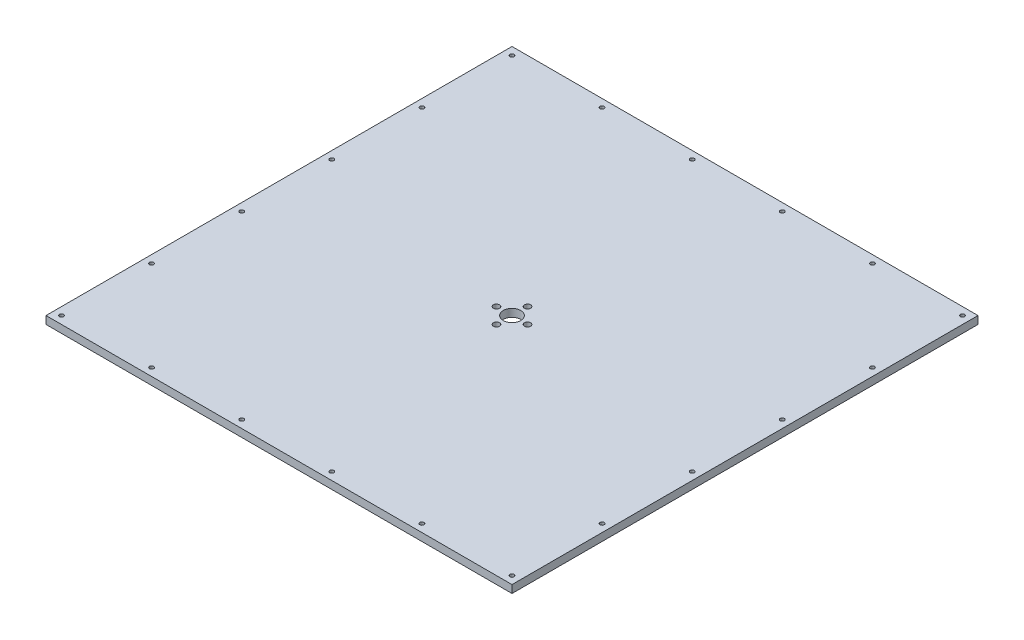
ISO-10303-21;
HEADER;
FILE_DESCRIPTION(('STEP AP214'),'2;1');
FILE_NAME('part.step','',(''),(''),'','','');
FILE_SCHEMA(('AUTOMOTIVE_DESIGN { 1 0 10303 214 1 1 1 1 }'));
ENDSEC;
DATA;
#1=APPLICATION_CONTEXT('core data for automotive mechanical design processes');
#2=APPLICATION_PROTOCOL_DEFINITION('international standard','automotive_design',2000,#1);
#3=PRODUCT_CONTEXT('',#1,'mechanical');
#4=PRODUCT('Part','Part','',(#3));
#5=PRODUCT_RELATED_PRODUCT_CATEGORY('part','',(#4));
#6=PRODUCT_DEFINITION_FORMATION('','',#4);
#7=PRODUCT_DEFINITION_CONTEXT('part definition',#1,'design');
#8=PRODUCT_DEFINITION('design','',#6,#7);
#9=PRODUCT_DEFINITION_SHAPE('','',#8);
#10=(LENGTH_UNIT() NAMED_UNIT(*) SI_UNIT(.MILLI.,.METRE.));
#11=(NAMED_UNIT(*) PLANE_ANGLE_UNIT() SI_UNIT($,.RADIAN.));
#12=(NAMED_UNIT(*) SI_UNIT($,.STERADIAN.) SOLID_ANGLE_UNIT());
#13=UNCERTAINTY_MEASURE_WITH_UNIT(LENGTH_MEASURE(1.E-05),#10,'distance_accuracy_value','');
#14=(GEOMETRIC_REPRESENTATION_CONTEXT(3) GLOBAL_UNCERTAINTY_ASSIGNED_CONTEXT((#13)) GLOBAL_UNIT_ASSIGNED_CONTEXT((#10,
#11,#12)) REPRESENTATION_CONTEXT('',''));
#15=CARTESIAN_POINT('',(0.,0.,0.));
#16=DIRECTION('',(0.,0.,1.));
#17=DIRECTION('',(1.,0.,0.));
#18=AXIS2_PLACEMENT_3D('',#15,#16,#17);
#19=CARTESIAN_POINT('',(381.,12.7,-381.));
#20=DIRECTION('',(-1.,0.,0.));
#21=DIRECTION('',(0.,0.,1.));
#22=AXIS2_PLACEMENT_3D('',#19,#20,#21);
#23=PLANE('',#22);
#24=DIRECTION('',(0.,0.,-1.));
#25=VECTOR('',#24,1.);
#26=CARTESIAN_POINT('',(381.,0.,-381.));
#27=LINE('',#26,#25);
#28=CARTESIAN_POINT('',(381.,0.,381.));
#29=VERTEX_POINT('',#28);
#30=CARTESIAN_POINT('',(381.,0.,-381.));
#31=VERTEX_POINT('',#30);
#32=EDGE_CURVE('E104',#29,#31,#27,.T.);
#33=ORIENTED_EDGE('',*,*,#32,.T.);
#34=DIRECTION('',(0.,-1.,0.));
#35=VECTOR('',#34,1.);
#36=CARTESIAN_POINT('',(381.,12.7,-381.));
#37=LINE('',#36,#35);
#38=CARTESIAN_POINT('',(381.,12.7,-381.));
#39=VERTEX_POINT('',#38);
#40=EDGE_CURVE('E95',#39,#31,#37,.T.);
#41=ORIENTED_EDGE('',*,*,#40,.F.);
#42=DIRECTION('',(0.,0.,-1.));
#43=VECTOR('',#42,1.);
#44=CARTESIAN_POINT('',(381.,12.7,-381.));
#45=LINE('',#44,#43);
#46=CARTESIAN_POINT('',(381.,12.7,381.));
#47=VERTEX_POINT('',#46);
#48=EDGE_CURVE('E89',#47,#39,#45,.T.);
#49=ORIENTED_EDGE('',*,*,#48,.F.);
#50=DIRECTION('',(0.,-1.,0.));
#51=VECTOR('',#50,1.);
#52=CARTESIAN_POINT('',(381.,12.7,381.));
#53=LINE('',#52,#51);
#54=EDGE_CURVE('E100',#47,#29,#53,.T.);
#55=ORIENTED_EDGE('',*,*,#54,.T.);
#56=EDGE_LOOP('',(#33,#41,#49,#55));
#57=FACE_BOUND('',#56,.T.);
#58=ADVANCED_FACE('F35',(#57),#23,.F.);
#59=CARTESIAN_POINT('',(-381.,12.7,-381.));
#60=DIRECTION('',(0.,0.,1.));
#61=DIRECTION('',(1.,0.,0.));
#62=AXIS2_PLACEMENT_3D('',#59,#60,#61);
#63=PLANE('',#62);
#64=DIRECTION('',(-1.,0.,0.));
#65=VECTOR('',#64,1.);
#66=CARTESIAN_POINT('',(-381.,0.,-381.));
#67=LINE('',#66,#65);
#68=CARTESIAN_POINT('',(-381.,0.,-381.));
#69=VERTEX_POINT('',#68);
#70=EDGE_CURVE('E94',#31,#69,#67,.T.);
#71=ORIENTED_EDGE('',*,*,#70,.T.);
#72=DIRECTION('',(0.,-1.,0.));
#73=VECTOR('',#72,1.);
#74=CARTESIAN_POINT('',(-381.,12.7,-381.));
#75=LINE('',#74,#73);
#76=CARTESIAN_POINT('',(-381.,12.7,-381.));
#77=VERTEX_POINT('',#76);
#78=EDGE_CURVE('E92',#77,#69,#75,.T.);
#79=ORIENTED_EDGE('',*,*,#78,.F.);
#80=DIRECTION('',(-1.,0.,0.));
#81=VECTOR('',#80,1.);
#82=CARTESIAN_POINT('',(-381.,12.7,-381.));
#83=LINE('',#82,#81);
#84=EDGE_CURVE('E83',#39,#77,#83,.T.);
#85=ORIENTED_EDGE('',*,*,#84,.F.);
#86=ORIENTED_EDGE('',*,*,#40,.T.);
#87=EDGE_LOOP('',(#71,#79,#85,#86));
#88=FACE_BOUND('',#87,.T.);
#89=ADVANCED_FACE('F93',(#88),#63,.F.);
#90=CARTESIAN_POINT('',(-381.,12.7,-381.));
#91=DIRECTION('',(1.,0.,0.));
#92=DIRECTION('',(0.,0.,-1.));
#93=AXIS2_PLACEMENT_3D('',#90,#91,#92);
#94=PLANE('',#93);
#95=DIRECTION('',(0.,0.,1.));
#96=VECTOR('',#95,1.);
#97=CARTESIAN_POINT('',(-381.,0.,-381.));
#98=LINE('',#97,#96);
#99=CARTESIAN_POINT('',(-381.,0.,381.));
#100=VERTEX_POINT('',#99);
#101=EDGE_CURVE('E69',#69,#100,#98,.T.);
#102=ORIENTED_EDGE('',*,*,#101,.T.);
#103=DIRECTION('',(0.,-1.,0.));
#104=VECTOR('',#103,1.);
#105=CARTESIAN_POINT('',(-381.,12.7,381.));
#106=LINE('',#105,#104);
#107=CARTESIAN_POINT('',(-381.,12.7,381.));
#108=VERTEX_POINT('',#107);
#109=EDGE_CURVE('E96',#108,#100,#106,.T.);
#110=ORIENTED_EDGE('',*,*,#109,.F.);
#111=DIRECTION('',(0.,0.,1.));
#112=VECTOR('',#111,1.);
#113=CARTESIAN_POINT('',(-381.,12.7,-381.));
#114=LINE('',#113,#112);
#115=EDGE_CURVE('E87',#77,#108,#114,.T.);
#116=ORIENTED_EDGE('',*,*,#115,.F.);
#117=ORIENTED_EDGE('',*,*,#78,.T.);
#118=EDGE_LOOP('',(#102,#110,#116,#117));
#119=FACE_BOUND('',#118,.T.);
#120=ADVANCED_FACE('F98',(#119),#94,.F.);
#121=CARTESIAN_POINT('',(-381.,12.7,381.));
#122=DIRECTION('',(0.,0.,-1.));
#123=DIRECTION('',(-1.,0.,0.));
#124=AXIS2_PLACEMENT_3D('',#121,#122,#123);
#125=PLANE('',#124);
#126=DIRECTION('',(1.,0.,0.));
#127=VECTOR('',#126,1.);
#128=CARTESIAN_POINT('',(-381.,0.,381.));
#129=LINE('',#128,#127);
#130=EDGE_CURVE('E75',#100,#29,#129,.T.);
#131=ORIENTED_EDGE('',*,*,#130,.T.);
#132=ORIENTED_EDGE('',*,*,#54,.F.);
#133=DIRECTION('',(1.,0.,0.));
#134=VECTOR('',#133,1.);
#135=CARTESIAN_POINT('',(-381.,12.7,381.));
#136=LINE('',#135,#134);
#137=EDGE_CURVE('E52',#108,#47,#136,.T.);
#138=ORIENTED_EDGE('',*,*,#137,.F.);
#139=ORIENTED_EDGE('',*,*,#109,.T.);
#140=EDGE_LOOP('',(#131,#132,#138,#139));
#141=FACE_BOUND('',#140,.T.);
#142=ADVANCED_FACE('F227',(#141),#125,.F.);
#143=CARTESIAN_POINT('',(0.,12.7,0.));
#144=DIRECTION('',(0.,1.,0.));
#145=DIRECTION('',(0.,0.,1.));
#146=AXIS2_PLACEMENT_3D('',#143,#144,#145);
#147=PLANE('',#146);
#148=CARTESIAN_POINT('',(0.,12.7,-25.4));
#149=DIRECTION('',(0.,1.,0.));
#150=DIRECTION('',(0.,0.,1.));
#151=AXIS2_PLACEMENT_3D('',#148,#149,#150);
#152=CIRCLE('',#151,5.04189999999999);
#153=CARTESIAN_POINT('',(0.,12.7,-20.3581));
#154=VERTEX_POINT('',#153);
#155=EDGE_CURVE('E571',#154,#154,#152,.T.);
#156=ORIENTED_EDGE('',*,*,#155,.F.);
#157=EDGE_LOOP('',(#156));
#158=FACE_BOUND('',#157,.T.);
#159=CARTESIAN_POINT('',(25.4,12.7,0.));
#160=DIRECTION('',(0.,1.,0.));
#161=DIRECTION('',(0.,0.,1.));
#162=AXIS2_PLACEMENT_3D('',#159,#160,#161);
#163=CIRCLE('',#162,5.04189999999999);
#164=CARTESIAN_POINT('',(25.4,12.7,5.04189999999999));
#165=VERTEX_POINT('',#164);
#166=EDGE_CURVE('E565',#165,#165,#163,.T.);
#167=ORIENTED_EDGE('',*,*,#166,.F.);
#168=EDGE_LOOP('',(#167));
#169=FACE_BOUND('',#168,.T.);
#170=CARTESIAN_POINT('',(0.,12.7,25.4));
#171=DIRECTION('',(0.,1.,0.));
#172=DIRECTION('',(0.,0.,1.));
#173=AXIS2_PLACEMENT_3D('',#170,#171,#172);
#174=CIRCLE('',#173,5.04189999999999);
#175=CARTESIAN_POINT('',(0.,12.7,30.4419));
#176=VERTEX_POINT('',#175);
#177=EDGE_CURVE('E559',#176,#176,#174,.T.);
#178=ORIENTED_EDGE('',*,*,#177,.F.);
#179=EDGE_LOOP('',(#178));
#180=FACE_BOUND('',#179,.T.);
#181=CARTESIAN_POINT('',(-25.4,12.7,0.));
#182=DIRECTION('',(0.,1.,0.));
#183=DIRECTION('',(0.,0.,1.));
#184=AXIS2_PLACEMENT_3D('',#181,#182,#183);
#185=CIRCLE('',#184,5.04189999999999);
#186=CARTESIAN_POINT('',(-25.4,12.7,5.04189999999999));
#187=VERTEX_POINT('',#186);
#188=EDGE_CURVE('E553',#187,#187,#185,.T.);
#189=ORIENTED_EDGE('',*,*,#188,.F.);
#190=EDGE_LOOP('',(#189));
#191=FACE_BOUND('',#190,.T.);
#192=CARTESIAN_POINT('',(0.,12.7,0.));
#193=DIRECTION('',(0.,1.,0.));
#194=DIRECTION('',(0.,0.,1.));
#195=AXIS2_PLACEMENT_3D('',#192,#193,#194);
#196=CIRCLE('',#195,14.2875);
#197=CARTESIAN_POINT('',(0.,12.7,14.2875));
#198=VERTEX_POINT('',#197);
#199=EDGE_CURVE('E545',#198,#198,#196,.T.);
#200=ORIENTED_EDGE('',*,*,#199,.F.);
#201=EDGE_LOOP('',(#200));
#202=FACE_BOUND('',#201,.T.);
#203=CARTESIAN_POINT('',(-220.98,12.7,-368.3));
#204=DIRECTION('',(0.,1.,0.));
#205=DIRECTION('',(0.,0.,1.));
#206=AXIS2_PLACEMENT_3D('',#203,#204,#205);
#207=CIRCLE('',#206,3.3782);
#208=CARTESIAN_POINT('',(-220.98,12.7,-364.9218));
#209=VERTEX_POINT('',#208);
#210=EDGE_CURVE('E535',#209,#209,#207,.T.);
#211=ORIENTED_EDGE('',*,*,#210,.F.);
#212=EDGE_LOOP('',(#211));
#213=FACE_BOUND('',#212,.T.);
#214=CARTESIAN_POINT('',(-368.3,12.7,-368.3));
#215=DIRECTION('',(0.,1.,0.));
#216=DIRECTION('',(0.,0.,1.));
#217=AXIS2_PLACEMENT_3D('',#214,#215,#216);
#218=CIRCLE('',#217,3.3782);
#219=CARTESIAN_POINT('',(-368.3,12.7,-364.9218));
#220=VERTEX_POINT('',#219);
#221=EDGE_CURVE('E533',#220,#220,#218,.T.);
#222=ORIENTED_EDGE('',*,*,#221,.F.);
#223=EDGE_LOOP('',(#222));
#224=FACE_BOUND('',#223,.T.);
#225=ORIENTED_EDGE('',*,*,#48,.T.);
#226=ORIENTED_EDGE('',*,*,#84,.T.);
#227=ORIENTED_EDGE('',*,*,#115,.T.);
#228=ORIENTED_EDGE('',*,*,#137,.T.);
#229=EDGE_LOOP('',(#225,#226,#227,#228));
#230=FACE_BOUND('',#229,.T.);
#231=CARTESIAN_POINT('',(-73.6600000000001,12.7,-368.3));
#232=DIRECTION('',(0.,1.,0.));
#233=DIRECTION('',(0.,0.,1.));
#234=AXIS2_PLACEMENT_3D('',#231,#232,#233);
#235=CIRCLE('',#234,3.3782);
#236=CARTESIAN_POINT('',(-73.6600000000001,12.7,-364.9218));
#237=VERTEX_POINT('',#236);
#238=EDGE_CURVE('E117',#237,#237,#235,.T.);
#239=ORIENTED_EDGE('',*,*,#238,.F.);
#240=EDGE_LOOP('',(#239));
#241=FACE_BOUND('',#240,.T.);
#242=CARTESIAN_POINT('',(73.6599999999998,12.7,-368.3));
#243=DIRECTION('',(0.,1.,0.));
#244=DIRECTION('',(0.,0.,1.));
#245=AXIS2_PLACEMENT_3D('',#242,#243,#244);
#246=CIRCLE('',#245,3.3782);
#247=CARTESIAN_POINT('',(73.6599999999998,12.7,-364.9218));
#248=VERTEX_POINT('',#247);
#249=EDGE_CURVE('E123',#248,#248,#246,.T.);
#250=ORIENTED_EDGE('',*,*,#249,.F.);
#251=EDGE_LOOP('',(#250));
#252=FACE_BOUND('',#251,.T.);
#253=CARTESIAN_POINT('',(220.98,12.7,-368.3));
#254=DIRECTION('',(0.,1.,0.));
#255=DIRECTION('',(0.,0.,1.));
#256=AXIS2_PLACEMENT_3D('',#253,#254,#255);
#257=CIRCLE('',#256,3.3782);
#258=CARTESIAN_POINT('',(220.98,12.7,-364.9218));
#259=VERTEX_POINT('',#258);
#260=EDGE_CURVE('E129',#259,#259,#257,.T.);
#261=ORIENTED_EDGE('',*,*,#260,.F.);
#262=EDGE_LOOP('',(#261));
#263=FACE_BOUND('',#262,.T.);
#264=CARTESIAN_POINT('',(368.3,12.7,-368.3));
#265=DIRECTION('',(0.,1.,0.));
#266=DIRECTION('',(0.,0.,1.));
#267=AXIS2_PLACEMENT_3D('',#264,#265,#266);
#268=CIRCLE('',#267,3.3782);
#269=CARTESIAN_POINT('',(368.3,12.7,-364.9218));
#270=VERTEX_POINT('',#269);
#271=EDGE_CURVE('E135',#270,#270,#268,.T.);
#272=ORIENTED_EDGE('',*,*,#271,.F.);
#273=EDGE_LOOP('',(#272));
#274=FACE_BOUND('',#273,.T.);
#275=CARTESIAN_POINT('',(-368.3,12.7,-220.98));
#276=DIRECTION('',(0.,1.,0.));
#277=DIRECTION('',(0.,0.,1.));
#278=AXIS2_PLACEMENT_3D('',#275,#276,#277);
#279=CIRCLE('',#278,3.3782);
#280=CARTESIAN_POINT('',(-368.3,12.7,-217.6018));
#281=VERTEX_POINT('',#280);
#282=EDGE_CURVE('E141',#281,#281,#279,.T.);
#283=ORIENTED_EDGE('',*,*,#282,.F.);
#284=EDGE_LOOP('',(#283));
#285=FACE_BOUND('',#284,.T.);
#286=CARTESIAN_POINT('',(368.3,12.7,-220.98));
#287=DIRECTION('',(0.,1.,0.));
#288=DIRECTION('',(0.,0.,1.));
#289=AXIS2_PLACEMENT_3D('',#286,#287,#288);
#290=CIRCLE('',#289,3.3782);
#291=CARTESIAN_POINT('',(368.3,12.7,-217.6018));
#292=VERTEX_POINT('',#291);
#293=EDGE_CURVE('E147',#292,#292,#290,.T.);
#294=ORIENTED_EDGE('',*,*,#293,.F.);
#295=EDGE_LOOP('',(#294));
#296=FACE_BOUND('',#295,.T.);
#297=CARTESIAN_POINT('',(-368.3,12.7,-73.6600000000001));
#298=DIRECTION('',(0.,1.,0.));
#299=DIRECTION('',(0.,0.,1.));
#300=AXIS2_PLACEMENT_3D('',#297,#298,#299);
#301=CIRCLE('',#300,3.3782);
#302=CARTESIAN_POINT('',(-368.3,12.7,-70.2818000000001));
#303=VERTEX_POINT('',#302);
#304=EDGE_CURVE('E153',#303,#303,#301,.T.);
#305=ORIENTED_EDGE('',*,*,#304,.F.);
#306=EDGE_LOOP('',(#305));
#307=FACE_BOUND('',#306,.T.);
#308=CARTESIAN_POINT('',(368.3,12.7,-73.6600000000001));
#309=DIRECTION('',(0.,1.,0.));
#310=DIRECTION('',(0.,0.,1.));
#311=AXIS2_PLACEMENT_3D('',#308,#309,#310);
#312=CIRCLE('',#311,3.3782);
#313=CARTESIAN_POINT('',(368.3,12.7,-70.2818000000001));
#314=VERTEX_POINT('',#313);
#315=EDGE_CURVE('E159',#314,#314,#312,.T.);
#316=ORIENTED_EDGE('',*,*,#315,.F.);
#317=EDGE_LOOP('',(#316));
#318=FACE_BOUND('',#317,.T.);
#319=CARTESIAN_POINT('',(-368.3,12.7,73.6599999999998));
#320=DIRECTION('',(0.,1.,0.));
#321=DIRECTION('',(0.,0.,1.));
#322=AXIS2_PLACEMENT_3D('',#319,#320,#321);
#323=CIRCLE('',#322,3.3782);
#324=CARTESIAN_POINT('',(-368.3,12.7,77.0381999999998));
#325=VERTEX_POINT('',#324);
#326=EDGE_CURVE('E165',#325,#325,#323,.T.);
#327=ORIENTED_EDGE('',*,*,#326,.F.);
#328=EDGE_LOOP('',(#327));
#329=FACE_BOUND('',#328,.T.);
#330=CARTESIAN_POINT('',(368.3,12.7,73.6599999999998));
#331=DIRECTION('',(0.,1.,0.));
#332=DIRECTION('',(0.,0.,1.));
#333=AXIS2_PLACEMENT_3D('',#330,#331,#332);
#334=CIRCLE('',#333,3.3782);
#335=CARTESIAN_POINT('',(368.3,12.7,77.0381999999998));
#336=VERTEX_POINT('',#335);
#337=EDGE_CURVE('E171',#336,#336,#334,.T.);
#338=ORIENTED_EDGE('',*,*,#337,.F.);
#339=EDGE_LOOP('',(#338));
#340=FACE_BOUND('',#339,.T.);
#341=CARTESIAN_POINT('',(-368.3,12.7,220.98));
#342=DIRECTION('',(0.,1.,0.));
#343=DIRECTION('',(0.,0.,1.));
#344=AXIS2_PLACEMENT_3D('',#341,#342,#343);
#345=CIRCLE('',#344,3.3782);
#346=CARTESIAN_POINT('',(-368.3,12.7,224.3582));
#347=VERTEX_POINT('',#346);
#348=EDGE_CURVE('E177',#347,#347,#345,.T.);
#349=ORIENTED_EDGE('',*,*,#348,.F.);
#350=EDGE_LOOP('',(#349));
#351=FACE_BOUND('',#350,.T.);
#352=CARTESIAN_POINT('',(368.3,12.7,220.98));
#353=DIRECTION('',(0.,1.,0.));
#354=DIRECTION('',(0.,0.,1.));
#355=AXIS2_PLACEMENT_3D('',#352,#353,#354);
#356=CIRCLE('',#355,3.3782);
#357=CARTESIAN_POINT('',(368.3,12.7,224.3582));
#358=VERTEX_POINT('',#357);
#359=EDGE_CURVE('E183',#358,#358,#356,.T.);
#360=ORIENTED_EDGE('',*,*,#359,.F.);
#361=EDGE_LOOP('',(#360));
#362=FACE_BOUND('',#361,.T.);
#363=CARTESIAN_POINT('',(-368.3,12.7,368.3));
#364=DIRECTION('',(0.,1.,0.));
#365=DIRECTION('',(0.,0.,1.));
#366=AXIS2_PLACEMENT_3D('',#363,#364,#365);
#367=CIRCLE('',#366,3.3782);
#368=CARTESIAN_POINT('',(-368.3,12.7,371.6782));
#369=VERTEX_POINT('',#368);
#370=EDGE_CURVE('E189',#369,#369,#367,.T.);
#371=ORIENTED_EDGE('',*,*,#370,.F.);
#372=EDGE_LOOP('',(#371));
#373=FACE_BOUND('',#372,.T.);
#374=CARTESIAN_POINT('',(-220.98,12.7,368.3));
#375=DIRECTION('',(0.,1.,0.));
#376=DIRECTION('',(0.,0.,1.));
#377=AXIS2_PLACEMENT_3D('',#374,#375,#376);
#378=CIRCLE('',#377,3.3782);
#379=CARTESIAN_POINT('',(-220.98,12.7,371.6782));
#380=VERTEX_POINT('',#379);
#381=EDGE_CURVE('E195',#380,#380,#378,.T.);
#382=ORIENTED_EDGE('',*,*,#381,.F.);
#383=EDGE_LOOP('',(#382));
#384=FACE_BOUND('',#383,.T.);
#385=CARTESIAN_POINT('',(-73.6600000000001,12.7,368.3));
#386=DIRECTION('',(0.,1.,0.));
#387=DIRECTION('',(0.,0.,1.));
#388=AXIS2_PLACEMENT_3D('',#385,#386,#387);
#389=CIRCLE('',#388,3.3782);
#390=CARTESIAN_POINT('',(-73.6600000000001,12.7,371.6782));
#391=VERTEX_POINT('',#390);
#392=EDGE_CURVE('E201',#391,#391,#389,.T.);
#393=ORIENTED_EDGE('',*,*,#392,.F.);
#394=EDGE_LOOP('',(#393));
#395=FACE_BOUND('',#394,.T.);
#396=CARTESIAN_POINT('',(73.6599999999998,12.7,368.3));
#397=DIRECTION('',(0.,1.,0.));
#398=DIRECTION('',(0.,0.,1.));
#399=AXIS2_PLACEMENT_3D('',#396,#397,#398);
#400=CIRCLE('',#399,3.3782);
#401=CARTESIAN_POINT('',(73.6599999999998,12.7,371.6782));
#402=VERTEX_POINT('',#401);
#403=EDGE_CURVE('E207',#402,#402,#400,.T.);
#404=ORIENTED_EDGE('',*,*,#403,.F.);
#405=EDGE_LOOP('',(#404));
#406=FACE_BOUND('',#405,.T.);
#407=CARTESIAN_POINT('',(220.98,12.7,368.3));
#408=DIRECTION('',(0.,1.,0.));
#409=DIRECTION('',(0.,0.,1.));
#410=AXIS2_PLACEMENT_3D('',#407,#408,#409);
#411=CIRCLE('',#410,3.3782);
#412=CARTESIAN_POINT('',(220.98,12.7,371.6782));
#413=VERTEX_POINT('',#412);
#414=EDGE_CURVE('E213',#413,#413,#411,.T.);
#415=ORIENTED_EDGE('',*,*,#414,.F.);
#416=EDGE_LOOP('',(#415));
#417=FACE_BOUND('',#416,.T.);
#418=CARTESIAN_POINT('',(368.3,12.7,368.3));
#419=DIRECTION('',(0.,1.,0.));
#420=DIRECTION('',(0.,0.,1.));
#421=AXIS2_PLACEMENT_3D('',#418,#419,#420);
#422=CIRCLE('',#421,3.3782);
#423=CARTESIAN_POINT('',(368.3,12.7,371.6782));
#424=VERTEX_POINT('',#423);
#425=EDGE_CURVE('E11',#424,#424,#422,.T.);
#426=ORIENTED_EDGE('',*,*,#425,.F.);
#427=EDGE_LOOP('',(#426));
#428=FACE_BOUND('',#427,.T.);
#429=ADVANCED_FACE('F84',(#158,#169,#180,#191,#202,#213,#224,#230,#241,#252,#263,#274,#285,#296,
#307,#318,#329,#340,#351,#362,#373,#384,#395,#406,#417,#428),#147,.T.);
#430=CARTESIAN_POINT('',(0.,0.,0.));
#431=DIRECTION('',(0.,1.,0.));
#432=DIRECTION('',(0.,0.,1.));
#433=AXIS2_PLACEMENT_3D('',#430,#431,#432);
#434=PLANE('',#433);
#435=CARTESIAN_POINT('',(0.,0.,-25.4));
#436=DIRECTION('',(0.,1.,0.));
#437=DIRECTION('',(0.,0.,1.));
#438=AXIS2_PLACEMENT_3D('',#435,#436,#437);
#439=CIRCLE('',#438,5.0419);
#440=CARTESIAN_POINT('',(0.,0.,-20.3581));
#441=VERTEX_POINT('',#440);
#442=EDGE_CURVE('E568',#441,#441,#439,.T.);
#443=ORIENTED_EDGE('',*,*,#442,.T.);
#444=EDGE_LOOP('',(#443));
#445=FACE_BOUND('',#444,.T.);
#446=CARTESIAN_POINT('',(25.4,0.,0.));
#447=DIRECTION('',(0.,1.,0.));
#448=DIRECTION('',(0.,0.,1.));
#449=AXIS2_PLACEMENT_3D('',#446,#447,#448);
#450=CIRCLE('',#449,5.0419);
#451=CARTESIAN_POINT('',(25.4,0.,5.0419));
#452=VERTEX_POINT('',#451);
#453=EDGE_CURVE('E562',#452,#452,#450,.T.);
#454=ORIENTED_EDGE('',*,*,#453,.T.);
#455=EDGE_LOOP('',(#454));
#456=FACE_BOUND('',#455,.T.);
#457=CARTESIAN_POINT('',(0.,0.,25.4));
#458=DIRECTION('',(0.,1.,0.));
#459=DIRECTION('',(0.,0.,1.));
#460=AXIS2_PLACEMENT_3D('',#457,#458,#459);
#461=CIRCLE('',#460,5.0419);
#462=CARTESIAN_POINT('',(0.,0.,30.4419));
#463=VERTEX_POINT('',#462);
#464=EDGE_CURVE('E556',#463,#463,#461,.T.);
#465=ORIENTED_EDGE('',*,*,#464,.T.);
#466=EDGE_LOOP('',(#465));
#467=FACE_BOUND('',#466,.T.);
#468=CARTESIAN_POINT('',(-25.4,0.,0.));
#469=DIRECTION('',(0.,1.,0.));
#470=DIRECTION('',(0.,0.,1.));
#471=AXIS2_PLACEMENT_3D('',#468,#469,#470);
#472=CIRCLE('',#471,5.0419);
#473=CARTESIAN_POINT('',(-25.4,0.,5.0419));
#474=VERTEX_POINT('',#473);
#475=EDGE_CURVE('E548',#474,#474,#472,.T.);
#476=ORIENTED_EDGE('',*,*,#475,.T.);
#477=EDGE_LOOP('',(#476));
#478=FACE_BOUND('',#477,.T.);
#479=CARTESIAN_POINT('',(0.,0.,0.));
#480=DIRECTION('',(0.,1.,0.));
#481=DIRECTION('',(0.,0.,1.));
#482=AXIS2_PLACEMENT_3D('',#479,#480,#481);
#483=CIRCLE('',#482,14.2875);
#484=CARTESIAN_POINT('',(0.,0.,14.2875));
#485=VERTEX_POINT('',#484);
#486=EDGE_CURVE('E544',#485,#485,#483,.T.);
#487=ORIENTED_EDGE('',*,*,#486,.T.);
#488=EDGE_LOOP('',(#487));
#489=FACE_BOUND('',#488,.T.);
#490=CARTESIAN_POINT('',(-220.98,0.,-368.3));
#491=DIRECTION('',(0.,1.,0.));
#492=DIRECTION('',(0.,0.,1.));
#493=AXIS2_PLACEMENT_3D('',#490,#491,#492);
#494=CIRCLE('',#493,3.3782);
#495=CARTESIAN_POINT('',(-220.98,0.,-364.9218));
#496=VERTEX_POINT('',#495);
#497=EDGE_CURVE('E539',#496,#496,#494,.T.);
#498=ORIENTED_EDGE('',*,*,#497,.T.);
#499=EDGE_LOOP('',(#498));
#500=FACE_BOUND('',#499,.T.);
#501=CARTESIAN_POINT('',(-368.3,0.,-368.3));
#502=DIRECTION('',(0.,1.,0.));
#503=DIRECTION('',(0.,0.,1.));
#504=AXIS2_PLACEMENT_3D('',#501,#502,#503);
#505=CIRCLE('',#504,3.3782);
#506=CARTESIAN_POINT('',(-368.3,0.,-364.9218));
#507=VERTEX_POINT('',#506);
#508=EDGE_CURVE('E107',#507,#507,#505,.T.);
#509=ORIENTED_EDGE('',*,*,#508,.T.);
#510=EDGE_LOOP('',(#509));
#511=FACE_BOUND('',#510,.T.);
#512=ORIENTED_EDGE('',*,*,#32,.F.);
#513=ORIENTED_EDGE('',*,*,#130,.F.);
#514=ORIENTED_EDGE('',*,*,#101,.F.);
#515=ORIENTED_EDGE('',*,*,#70,.F.);
#516=EDGE_LOOP('',(#512,#513,#514,#515));
#517=FACE_BOUND('',#516,.T.);
#518=CARTESIAN_POINT('',(-73.6600000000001,0.,-368.3));
#519=DIRECTION('',(0.,1.,0.));
#520=DIRECTION('',(0.,0.,1.));
#521=AXIS2_PLACEMENT_3D('',#518,#519,#520);
#522=CIRCLE('',#521,3.3782);
#523=CARTESIAN_POINT('',(-73.6600000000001,0.,-364.9218));
#524=VERTEX_POINT('',#523);
#525=EDGE_CURVE('E114',#524,#524,#522,.T.);
#526=ORIENTED_EDGE('',*,*,#525,.T.);
#527=EDGE_LOOP('',(#526));
#528=FACE_BOUND('',#527,.T.);
#529=CARTESIAN_POINT('',(73.6599999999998,0.,-368.3));
#530=DIRECTION('',(0.,1.,0.));
#531=DIRECTION('',(0.,0.,1.));
#532=AXIS2_PLACEMENT_3D('',#529,#530,#531);
#533=CIRCLE('',#532,3.3782);
#534=CARTESIAN_POINT('',(73.6599999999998,0.,-364.9218));
#535=VERTEX_POINT('',#534);
#536=EDGE_CURVE('E120',#535,#535,#533,.T.);
#537=ORIENTED_EDGE('',*,*,#536,.T.);
#538=EDGE_LOOP('',(#537));
#539=FACE_BOUND('',#538,.T.);
#540=CARTESIAN_POINT('',(220.98,0.,-368.3));
#541=DIRECTION('',(0.,1.,0.));
#542=DIRECTION('',(0.,0.,1.));
#543=AXIS2_PLACEMENT_3D('',#540,#541,#542);
#544=CIRCLE('',#543,3.3782);
#545=CARTESIAN_POINT('',(220.98,0.,-364.9218));
#546=VERTEX_POINT('',#545);
#547=EDGE_CURVE('E126',#546,#546,#544,.T.);
#548=ORIENTED_EDGE('',*,*,#547,.T.);
#549=EDGE_LOOP('',(#548));
#550=FACE_BOUND('',#549,.T.);
#551=CARTESIAN_POINT('',(368.3,0.,-368.3));
#552=DIRECTION('',(0.,1.,0.));
#553=DIRECTION('',(0.,0.,1.));
#554=AXIS2_PLACEMENT_3D('',#551,#552,#553);
#555=CIRCLE('',#554,3.3782);
#556=CARTESIAN_POINT('',(368.3,0.,-364.9218));
#557=VERTEX_POINT('',#556);
#558=EDGE_CURVE('E132',#557,#557,#555,.T.);
#559=ORIENTED_EDGE('',*,*,#558,.T.);
#560=EDGE_LOOP('',(#559));
#561=FACE_BOUND('',#560,.T.);
#562=CARTESIAN_POINT('',(-368.3,0.,-220.98));
#563=DIRECTION('',(0.,1.,0.));
#564=DIRECTION('',(0.,0.,1.));
#565=AXIS2_PLACEMENT_3D('',#562,#563,#564);
#566=CIRCLE('',#565,3.3782);
#567=CARTESIAN_POINT('',(-368.3,0.,-217.6018));
#568=VERTEX_POINT('',#567);
#569=EDGE_CURVE('E138',#568,#568,#566,.T.);
#570=ORIENTED_EDGE('',*,*,#569,.T.);
#571=EDGE_LOOP('',(#570));
#572=FACE_BOUND('',#571,.T.);
#573=CARTESIAN_POINT('',(368.3,0.,-220.98));
#574=DIRECTION('',(0.,1.,0.));
#575=DIRECTION('',(0.,0.,1.));
#576=AXIS2_PLACEMENT_3D('',#573,#574,#575);
#577=CIRCLE('',#576,3.3782);
#578=CARTESIAN_POINT('',(368.3,0.,-217.6018));
#579=VERTEX_POINT('',#578);
#580=EDGE_CURVE('E144',#579,#579,#577,.T.);
#581=ORIENTED_EDGE('',*,*,#580,.T.);
#582=EDGE_LOOP('',(#581));
#583=FACE_BOUND('',#582,.T.);
#584=CARTESIAN_POINT('',(-368.3,0.,-73.6600000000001));
#585=DIRECTION('',(0.,1.,0.));
#586=DIRECTION('',(0.,0.,1.));
#587=AXIS2_PLACEMENT_3D('',#584,#585,#586);
#588=CIRCLE('',#587,3.3782);
#589=CARTESIAN_POINT('',(-368.3,0.,-70.2818000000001));
#590=VERTEX_POINT('',#589);
#591=EDGE_CURVE('E150',#590,#590,#588,.T.);
#592=ORIENTED_EDGE('',*,*,#591,.T.);
#593=EDGE_LOOP('',(#592));
#594=FACE_BOUND('',#593,.T.);
#595=CARTESIAN_POINT('',(368.3,0.,-73.6600000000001));
#596=DIRECTION('',(0.,1.,0.));
#597=DIRECTION('',(0.,0.,1.));
#598=AXIS2_PLACEMENT_3D('',#595,#596,#597);
#599=CIRCLE('',#598,3.3782);
#600=CARTESIAN_POINT('',(368.3,0.,-70.2818000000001));
#601=VERTEX_POINT('',#600);
#602=EDGE_CURVE('E156',#601,#601,#599,.T.);
#603=ORIENTED_EDGE('',*,*,#602,.T.);
#604=EDGE_LOOP('',(#603));
#605=FACE_BOUND('',#604,.T.);
#606=CARTESIAN_POINT('',(-368.3,0.,73.6599999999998));
#607=DIRECTION('',(0.,1.,0.));
#608=DIRECTION('',(0.,0.,1.));
#609=AXIS2_PLACEMENT_3D('',#606,#607,#608);
#610=CIRCLE('',#609,3.3782);
#611=CARTESIAN_POINT('',(-368.3,0.,77.0381999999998));
#612=VERTEX_POINT('',#611);
#613=EDGE_CURVE('E162',#612,#612,#610,.T.);
#614=ORIENTED_EDGE('',*,*,#613,.T.);
#615=EDGE_LOOP('',(#614));
#616=FACE_BOUND('',#615,.T.);
#617=CARTESIAN_POINT('',(368.3,0.,73.6599999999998));
#618=DIRECTION('',(0.,1.,0.));
#619=DIRECTION('',(0.,0.,1.));
#620=AXIS2_PLACEMENT_3D('',#617,#618,#619);
#621=CIRCLE('',#620,3.3782);
#622=CARTESIAN_POINT('',(368.3,0.,77.0381999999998));
#623=VERTEX_POINT('',#622);
#624=EDGE_CURVE('E168',#623,#623,#621,.T.);
#625=ORIENTED_EDGE('',*,*,#624,.T.);
#626=EDGE_LOOP('',(#625));
#627=FACE_BOUND('',#626,.T.);
#628=CARTESIAN_POINT('',(-368.3,0.,220.98));
#629=DIRECTION('',(0.,1.,0.));
#630=DIRECTION('',(0.,0.,1.));
#631=AXIS2_PLACEMENT_3D('',#628,#629,#630);
#632=CIRCLE('',#631,3.3782);
#633=CARTESIAN_POINT('',(-368.3,0.,224.3582));
#634=VERTEX_POINT('',#633);
#635=EDGE_CURVE('E174',#634,#634,#632,.T.);
#636=ORIENTED_EDGE('',*,*,#635,.T.);
#637=EDGE_LOOP('',(#636));
#638=FACE_BOUND('',#637,.T.);
#639=CARTESIAN_POINT('',(368.3,0.,220.98));
#640=DIRECTION('',(0.,1.,0.));
#641=DIRECTION('',(0.,0.,1.));
#642=AXIS2_PLACEMENT_3D('',#639,#640,#641);
#643=CIRCLE('',#642,3.3782);
#644=CARTESIAN_POINT('',(368.3,0.,224.3582));
#645=VERTEX_POINT('',#644);
#646=EDGE_CURVE('E180',#645,#645,#643,.T.);
#647=ORIENTED_EDGE('',*,*,#646,.T.);
#648=EDGE_LOOP('',(#647));
#649=FACE_BOUND('',#648,.T.);
#650=CARTESIAN_POINT('',(-368.3,0.,368.3));
#651=DIRECTION('',(0.,1.,0.));
#652=DIRECTION('',(0.,0.,1.));
#653=AXIS2_PLACEMENT_3D('',#650,#651,#652);
#654=CIRCLE('',#653,3.3782);
#655=CARTESIAN_POINT('',(-368.3,0.,371.6782));
#656=VERTEX_POINT('',#655);
#657=EDGE_CURVE('E186',#656,#656,#654,.T.);
#658=ORIENTED_EDGE('',*,*,#657,.T.);
#659=EDGE_LOOP('',(#658));
#660=FACE_BOUND('',#659,.T.);
#661=CARTESIAN_POINT('',(-220.98,0.,368.3));
#662=DIRECTION('',(0.,1.,0.));
#663=DIRECTION('',(0.,0.,1.));
#664=AXIS2_PLACEMENT_3D('',#661,#662,#663);
#665=CIRCLE('',#664,3.3782);
#666=CARTESIAN_POINT('',(-220.98,0.,371.6782));
#667=VERTEX_POINT('',#666);
#668=EDGE_CURVE('E192',#667,#667,#665,.T.);
#669=ORIENTED_EDGE('',*,*,#668,.T.);
#670=EDGE_LOOP('',(#669));
#671=FACE_BOUND('',#670,.T.);
#672=CARTESIAN_POINT('',(-73.6600000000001,0.,368.3));
#673=DIRECTION('',(0.,1.,0.));
#674=DIRECTION('',(0.,0.,1.));
#675=AXIS2_PLACEMENT_3D('',#672,#673,#674);
#676=CIRCLE('',#675,3.3782);
#677=CARTESIAN_POINT('',(-73.6600000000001,0.,371.6782));
#678=VERTEX_POINT('',#677);
#679=EDGE_CURVE('E198',#678,#678,#676,.T.);
#680=ORIENTED_EDGE('',*,*,#679,.T.);
#681=EDGE_LOOP('',(#680));
#682=FACE_BOUND('',#681,.T.);
#683=CARTESIAN_POINT('',(73.6599999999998,0.,368.3));
#684=DIRECTION('',(0.,1.,0.));
#685=DIRECTION('',(0.,0.,1.));
#686=AXIS2_PLACEMENT_3D('',#683,#684,#685);
#687=CIRCLE('',#686,3.3782);
#688=CARTESIAN_POINT('',(73.6599999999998,0.,371.6782));
#689=VERTEX_POINT('',#688);
#690=EDGE_CURVE('E204',#689,#689,#687,.T.);
#691=ORIENTED_EDGE('',*,*,#690,.T.);
#692=EDGE_LOOP('',(#691));
#693=FACE_BOUND('',#692,.T.);
#694=CARTESIAN_POINT('',(220.98,0.,368.3));
#695=DIRECTION('',(0.,1.,0.));
#696=DIRECTION('',(0.,0.,1.));
#697=AXIS2_PLACEMENT_3D('',#694,#695,#696);
#698=CIRCLE('',#697,3.3782);
#699=CARTESIAN_POINT('',(220.98,0.,371.6782));
#700=VERTEX_POINT('',#699);
#701=EDGE_CURVE('E210',#700,#700,#698,.T.);
#702=ORIENTED_EDGE('',*,*,#701,.T.);
#703=EDGE_LOOP('',(#702));
#704=FACE_BOUND('',#703,.T.);
#705=CARTESIAN_POINT('',(368.3,0.,368.3));
#706=DIRECTION('',(0.,1.,0.));
#707=DIRECTION('',(0.,0.,1.));
#708=AXIS2_PLACEMENT_3D('',#705,#706,#707);
#709=CIRCLE('',#708,3.3782);
#710=CARTESIAN_POINT('',(368.3,0.,371.6782));
#711=VERTEX_POINT('',#710);
#712=EDGE_CURVE('E44',#711,#711,#709,.T.);
#713=ORIENTED_EDGE('',*,*,#712,.T.);
#714=EDGE_LOOP('',(#713));
#715=FACE_BOUND('',#714,.T.);
#716=ADVANCED_FACE('F218',(#445,#456,#467,#478,#489,#500,#511,#517,#528,#539,#550,#561,#572,
#583,#594,#605,#616,#627,#638,#649,#660,#671,#682,#693,#704,#715),#434,.F.);
#717=CARTESIAN_POINT('',(-368.3,12.7,-368.3));
#718=DIRECTION('',(0.,1.,0.));
#719=DIRECTION('',(0.,0.,1.));
#720=AXIS2_PLACEMENT_3D('',#717,#718,#719);
#721=CYLINDRICAL_SURFACE('',#720,3.3782);
#722=ORIENTED_EDGE('',*,*,#508,.F.);
#723=EDGE_LOOP('',(#722));
#724=FACE_BOUND('',#723,.T.);
#725=ORIENTED_EDGE('',*,*,#221,.T.);
#726=EDGE_LOOP('',(#725));
#727=FACE_BOUND('',#726,.T.);
#728=ADVANCED_FACE('F234',(#724,#727),#721,.F.);
#729=CARTESIAN_POINT('',(-220.98,12.7,-368.3));
#730=DIRECTION('',(0.,1.,0.));
#731=DIRECTION('',(0.,0.,1.));
#732=AXIS2_PLACEMENT_3D('',#729,#730,#731);
#733=CYLINDRICAL_SURFACE('',#732,3.3782);
#734=ORIENTED_EDGE('',*,*,#497,.F.);
#735=EDGE_LOOP('',(#734));
#736=FACE_BOUND('',#735,.T.);
#737=ORIENTED_EDGE('',*,*,#210,.T.);
#738=EDGE_LOOP('',(#737));
#739=FACE_BOUND('',#738,.T.);
#740=ADVANCED_FACE('F254',(#736,#739),#733,.F.);
#741=CARTESIAN_POINT('',(-73.6600000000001,12.7,-368.3));
#742=DIRECTION('',(0.,1.,0.));
#743=DIRECTION('',(0.,0.,1.));
#744=AXIS2_PLACEMENT_3D('',#741,#742,#743);
#745=CYLINDRICAL_SURFACE('',#744,3.3782);
#746=ORIENTED_EDGE('',*,*,#525,.F.);
#747=EDGE_LOOP('',(#746));
#748=FACE_BOUND('',#747,.T.);
#749=ORIENTED_EDGE('',*,*,#238,.T.);
#750=EDGE_LOOP('',(#749));
#751=FACE_BOUND('',#750,.T.);
#752=ADVANCED_FACE('F250',(#748,#751),#745,.F.);
#753=CARTESIAN_POINT('',(73.6599999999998,12.7,-368.3));
#754=DIRECTION('',(0.,1.,0.));
#755=DIRECTION('',(0.,0.,1.));
#756=AXIS2_PLACEMENT_3D('',#753,#754,#755);
#757=CYLINDRICAL_SURFACE('',#756,3.3782);
#758=ORIENTED_EDGE('',*,*,#536,.F.);
#759=EDGE_LOOP('',(#758));
#760=FACE_BOUND('',#759,.T.);
#761=ORIENTED_EDGE('',*,*,#249,.T.);
#762=EDGE_LOOP('',(#761));
#763=FACE_BOUND('',#762,.T.);
#764=ADVANCED_FACE('F253',(#760,#763),#757,.F.);
#765=CARTESIAN_POINT('',(220.98,12.7,-368.3));
#766=DIRECTION('',(0.,1.,0.));
#767=DIRECTION('',(0.,0.,1.));
#768=AXIS2_PLACEMENT_3D('',#765,#766,#767);
#769=CYLINDRICAL_SURFACE('',#768,3.3782);
#770=ORIENTED_EDGE('',*,*,#547,.F.);
#771=EDGE_LOOP('',(#770));
#772=FACE_BOUND('',#771,.T.);
#773=ORIENTED_EDGE('',*,*,#260,.T.);
#774=EDGE_LOOP('',(#773));
#775=FACE_BOUND('',#774,.T.);
#776=ADVANCED_FACE('F258',(#772,#775),#769,.F.);
#777=CARTESIAN_POINT('',(368.3,12.7,-368.3));
#778=DIRECTION('',(0.,1.,0.));
#779=DIRECTION('',(0.,0.,1.));
#780=AXIS2_PLACEMENT_3D('',#777,#778,#779);
#781=CYLINDRICAL_SURFACE('',#780,3.3782);
#782=ORIENTED_EDGE('',*,*,#558,.F.);
#783=EDGE_LOOP('',(#782));
#784=FACE_BOUND('',#783,.T.);
#785=ORIENTED_EDGE('',*,*,#271,.T.);
#786=EDGE_LOOP('',(#785));
#787=FACE_BOUND('',#786,.T.);
#788=ADVANCED_FACE('F262',(#784,#787),#781,.F.);
#789=CARTESIAN_POINT('',(-368.3,12.7,-220.98));
#790=DIRECTION('',(0.,1.,0.));
#791=DIRECTION('',(0.,0.,1.));
#792=AXIS2_PLACEMENT_3D('',#789,#790,#791);
#793=CYLINDRICAL_SURFACE('',#792,3.3782);
#794=ORIENTED_EDGE('',*,*,#569,.F.);
#795=EDGE_LOOP('',(#794));
#796=FACE_BOUND('',#795,.T.);
#797=ORIENTED_EDGE('',*,*,#282,.T.);
#798=EDGE_LOOP('',(#797));
#799=FACE_BOUND('',#798,.T.);
#800=ADVANCED_FACE('F266',(#796,#799),#793,.F.);
#801=CARTESIAN_POINT('',(368.3,12.7,-220.98));
#802=DIRECTION('',(0.,1.,0.));
#803=DIRECTION('',(0.,0.,1.));
#804=AXIS2_PLACEMENT_3D('',#801,#802,#803);
#805=CYLINDRICAL_SURFACE('',#804,3.3782);
#806=ORIENTED_EDGE('',*,*,#580,.F.);
#807=EDGE_LOOP('',(#806));
#808=FACE_BOUND('',#807,.T.);
#809=ORIENTED_EDGE('',*,*,#293,.T.);
#810=EDGE_LOOP('',(#809));
#811=FACE_BOUND('',#810,.T.);
#812=ADVANCED_FACE('F270',(#808,#811),#805,.F.);
#813=CARTESIAN_POINT('',(-368.3,12.7,-73.6600000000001));
#814=DIRECTION('',(0.,1.,0.));
#815=DIRECTION('',(0.,0.,1.));
#816=AXIS2_PLACEMENT_3D('',#813,#814,#815);
#817=CYLINDRICAL_SURFACE('',#816,3.3782);
#818=ORIENTED_EDGE('',*,*,#591,.F.);
#819=EDGE_LOOP('',(#818));
#820=FACE_BOUND('',#819,.T.);
#821=ORIENTED_EDGE('',*,*,#304,.T.);
#822=EDGE_LOOP('',(#821));
#823=FACE_BOUND('',#822,.T.);
#824=ADVANCED_FACE('F274',(#820,#823),#817,.F.);
#825=CARTESIAN_POINT('',(368.3,12.7,-73.6600000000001));
#826=DIRECTION('',(0.,1.,0.));
#827=DIRECTION('',(0.,0.,1.));
#828=AXIS2_PLACEMENT_3D('',#825,#826,#827);
#829=CYLINDRICAL_SURFACE('',#828,3.3782);
#830=ORIENTED_EDGE('',*,*,#602,.F.);
#831=EDGE_LOOP('',(#830));
#832=FACE_BOUND('',#831,.T.);
#833=ORIENTED_EDGE('',*,*,#315,.T.);
#834=EDGE_LOOP('',(#833));
#835=FACE_BOUND('',#834,.T.);
#836=ADVANCED_FACE('F278',(#832,#835),#829,.F.);
#837=CARTESIAN_POINT('',(-368.3,12.7,73.6599999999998));
#838=DIRECTION('',(0.,1.,0.));
#839=DIRECTION('',(0.,0.,1.));
#840=AXIS2_PLACEMENT_3D('',#837,#838,#839);
#841=CYLINDRICAL_SURFACE('',#840,3.3782);
#842=ORIENTED_EDGE('',*,*,#613,.F.);
#843=EDGE_LOOP('',(#842));
#844=FACE_BOUND('',#843,.T.);
#845=ORIENTED_EDGE('',*,*,#326,.T.);
#846=EDGE_LOOP('',(#845));
#847=FACE_BOUND('',#846,.T.);
#848=ADVANCED_FACE('F282',(#844,#847),#841,.F.);
#849=CARTESIAN_POINT('',(368.3,12.7,73.6599999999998));
#850=DIRECTION('',(0.,1.,0.));
#851=DIRECTION('',(0.,0.,1.));
#852=AXIS2_PLACEMENT_3D('',#849,#850,#851);
#853=CYLINDRICAL_SURFACE('',#852,3.3782);
#854=ORIENTED_EDGE('',*,*,#624,.F.);
#855=EDGE_LOOP('',(#854));
#856=FACE_BOUND('',#855,.T.);
#857=ORIENTED_EDGE('',*,*,#337,.T.);
#858=EDGE_LOOP('',(#857));
#859=FACE_BOUND('',#858,.T.);
#860=ADVANCED_FACE('F286',(#856,#859),#853,.F.);
#861=CARTESIAN_POINT('',(-368.3,12.7,220.98));
#862=DIRECTION('',(0.,1.,0.));
#863=DIRECTION('',(0.,0.,1.));
#864=AXIS2_PLACEMENT_3D('',#861,#862,#863);
#865=CYLINDRICAL_SURFACE('',#864,3.3782);
#866=ORIENTED_EDGE('',*,*,#635,.F.);
#867=EDGE_LOOP('',(#866));
#868=FACE_BOUND('',#867,.T.);
#869=ORIENTED_EDGE('',*,*,#348,.T.);
#870=EDGE_LOOP('',(#869));
#871=FACE_BOUND('',#870,.T.);
#872=ADVANCED_FACE('F290',(#868,#871),#865,.F.);
#873=CARTESIAN_POINT('',(368.3,12.7,220.98));
#874=DIRECTION('',(0.,1.,0.));
#875=DIRECTION('',(0.,0.,1.));
#876=AXIS2_PLACEMENT_3D('',#873,#874,#875);
#877=CYLINDRICAL_SURFACE('',#876,3.3782);
#878=ORIENTED_EDGE('',*,*,#646,.F.);
#879=EDGE_LOOP('',(#878));
#880=FACE_BOUND('',#879,.T.);
#881=ORIENTED_EDGE('',*,*,#359,.T.);
#882=EDGE_LOOP('',(#881));
#883=FACE_BOUND('',#882,.T.);
#884=ADVANCED_FACE('F294',(#880,#883),#877,.F.);
#885=CARTESIAN_POINT('',(-368.3,12.7,368.3));
#886=DIRECTION('',(0.,1.,0.));
#887=DIRECTION('',(0.,0.,1.));
#888=AXIS2_PLACEMENT_3D('',#885,#886,#887);
#889=CYLINDRICAL_SURFACE('',#888,3.3782);
#890=ORIENTED_EDGE('',*,*,#657,.F.);
#891=EDGE_LOOP('',(#890));
#892=FACE_BOUND('',#891,.T.);
#893=ORIENTED_EDGE('',*,*,#370,.T.);
#894=EDGE_LOOP('',(#893));
#895=FACE_BOUND('',#894,.T.);
#896=ADVANCED_FACE('F298',(#892,#895),#889,.F.);
#897=CARTESIAN_POINT('',(-220.98,12.7,368.3));
#898=DIRECTION('',(0.,1.,0.));
#899=DIRECTION('',(0.,0.,1.));
#900=AXIS2_PLACEMENT_3D('',#897,#898,#899);
#901=CYLINDRICAL_SURFACE('',#900,3.3782);
#902=ORIENTED_EDGE('',*,*,#668,.F.);
#903=EDGE_LOOP('',(#902));
#904=FACE_BOUND('',#903,.T.);
#905=ORIENTED_EDGE('',*,*,#381,.T.);
#906=EDGE_LOOP('',(#905));
#907=FACE_BOUND('',#906,.T.);
#908=ADVANCED_FACE('F302',(#904,#907),#901,.F.);
#909=CARTESIAN_POINT('',(-73.6600000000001,12.7,368.3));
#910=DIRECTION('',(0.,1.,0.));
#911=DIRECTION('',(0.,0.,1.));
#912=AXIS2_PLACEMENT_3D('',#909,#910,#911);
#913=CYLINDRICAL_SURFACE('',#912,3.3782);
#914=ORIENTED_EDGE('',*,*,#679,.F.);
#915=EDGE_LOOP('',(#914));
#916=FACE_BOUND('',#915,.T.);
#917=ORIENTED_EDGE('',*,*,#392,.T.);
#918=EDGE_LOOP('',(#917));
#919=FACE_BOUND('',#918,.T.);
#920=ADVANCED_FACE('F306',(#916,#919),#913,.F.);
#921=CARTESIAN_POINT('',(73.6599999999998,12.7,368.3));
#922=DIRECTION('',(0.,1.,0.));
#923=DIRECTION('',(0.,0.,1.));
#924=AXIS2_PLACEMENT_3D('',#921,#922,#923);
#925=CYLINDRICAL_SURFACE('',#924,3.3782);
#926=ORIENTED_EDGE('',*,*,#690,.F.);
#927=EDGE_LOOP('',(#926));
#928=FACE_BOUND('',#927,.T.);
#929=ORIENTED_EDGE('',*,*,#403,.T.);
#930=EDGE_LOOP('',(#929));
#931=FACE_BOUND('',#930,.T.);
#932=ADVANCED_FACE('F310',(#928,#931),#925,.F.);
#933=CARTESIAN_POINT('',(220.98,12.7,368.3));
#934=DIRECTION('',(0.,1.,0.));
#935=DIRECTION('',(0.,0.,1.));
#936=AXIS2_PLACEMENT_3D('',#933,#934,#935);
#937=CYLINDRICAL_SURFACE('',#936,3.3782);
#938=ORIENTED_EDGE('',*,*,#701,.F.);
#939=EDGE_LOOP('',(#938));
#940=FACE_BOUND('',#939,.T.);
#941=ORIENTED_EDGE('',*,*,#414,.T.);
#942=EDGE_LOOP('',(#941));
#943=FACE_BOUND('',#942,.T.);
#944=ADVANCED_FACE('F223',(#940,#943),#937,.F.);
#945=CARTESIAN_POINT('',(368.3,12.7,368.3));
#946=DIRECTION('',(0.,1.,0.));
#947=DIRECTION('',(0.,0.,1.));
#948=AXIS2_PLACEMENT_3D('',#945,#946,#947);
#949=CYLINDRICAL_SURFACE('',#948,3.3782);
#950=ORIENTED_EDGE('',*,*,#712,.F.);
#951=EDGE_LOOP('',(#950));
#952=FACE_BOUND('',#951,.T.);
#953=ORIENTED_EDGE('',*,*,#425,.T.);
#954=EDGE_LOOP('',(#953));
#955=FACE_BOUND('',#954,.T.);
#956=ADVANCED_FACE('F37',(#952,#955),#949,.F.);
#957=CARTESIAN_POINT('',(0.,0.,0.));
#958=DIRECTION('',(0.,1.,0.));
#959=DIRECTION('',(0.,0.,1.));
#960=AXIS2_PLACEMENT_3D('',#957,#958,#959);
#961=CYLINDRICAL_SURFACE('',#960,14.2875);
#962=ORIENTED_EDGE('',*,*,#486,.F.);
#963=EDGE_LOOP('',(#962));
#964=FACE_BOUND('',#963,.T.);
#965=ORIENTED_EDGE('',*,*,#199,.T.);
#966=EDGE_LOOP('',(#965));
#967=FACE_BOUND('',#966,.T.);
#968=ADVANCED_FACE('F222',(#964,#967),#961,.F.);
#969=CARTESIAN_POINT('',(-25.4,12.7,0.));
#970=DIRECTION('',(0.,1.,0.));
#971=DIRECTION('',(0.,0.,1.));
#972=AXIS2_PLACEMENT_3D('',#969,#970,#971);
#973=CYLINDRICAL_SURFACE('',#972,5.04189999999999);
#974=ORIENTED_EDGE('',*,*,#475,.F.);
#975=EDGE_LOOP('',(#974));
#976=FACE_BOUND('',#975,.T.);
#977=ORIENTED_EDGE('',*,*,#188,.T.);
#978=EDGE_LOOP('',(#977));
#979=FACE_BOUND('',#978,.T.);
#980=ADVANCED_FACE('F335',(#976,#979),#973,.F.);
#981=CARTESIAN_POINT('',(0.,12.7,25.4));
#982=DIRECTION('',(0.,1.,0.));
#983=DIRECTION('',(0.,0.,1.));
#984=AXIS2_PLACEMENT_3D('',#981,#982,#983);
#985=CYLINDRICAL_SURFACE('',#984,5.04189999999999);
#986=ORIENTED_EDGE('',*,*,#464,.F.);
#987=EDGE_LOOP('',(#986));
#988=FACE_BOUND('',#987,.T.);
#989=ORIENTED_EDGE('',*,*,#177,.T.);
#990=EDGE_LOOP('',(#989));
#991=FACE_BOUND('',#990,.T.);
#992=ADVANCED_FACE('F343',(#988,#991),#985,.F.);
#993=CARTESIAN_POINT('',(25.4,12.7,0.));
#994=DIRECTION('',(0.,1.,0.));
#995=DIRECTION('',(0.,0.,1.));
#996=AXIS2_PLACEMENT_3D('',#993,#994,#995);
#997=CYLINDRICAL_SURFACE('',#996,5.04189999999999);
#998=ORIENTED_EDGE('',*,*,#453,.F.);
#999=EDGE_LOOP('',(#998));
#1000=FACE_BOUND('',#999,.T.);
#1001=ORIENTED_EDGE('',*,*,#166,.T.);
#1002=EDGE_LOOP('',(#1001));
#1003=FACE_BOUND('',#1002,.T.);
#1004=ADVANCED_FACE('F352',(#1000,#1003),#997,.F.);
#1005=CARTESIAN_POINT('',(0.,12.7,-25.4));
#1006=DIRECTION('',(0.,1.,0.));
#1007=DIRECTION('',(0.,0.,1.));
#1008=AXIS2_PLACEMENT_3D('',#1005,#1006,#1007);
#1009=CYLINDRICAL_SURFACE('',#1008,5.04189999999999);
#1010=ORIENTED_EDGE('',*,*,#442,.F.);
#1011=EDGE_LOOP('',(#1010));
#1012=FACE_BOUND('',#1011,.T.);
#1013=ORIENTED_EDGE('',*,*,#155,.T.);
#1014=EDGE_LOOP('',(#1013));
#1015=FACE_BOUND('',#1014,.T.);
#1016=ADVANCED_FACE('F360',(#1012,#1015),#1009,.F.);
#1017=CLOSED_SHELL('',(#58,#89,#120,#142,#429,#716,#728,#740,#752,#764,#776,#788,#800,#812,#824,
#836,#848,#860,#872,#884,#896,#908,#920,#932,#944,#956,#968,#980,#992,#1004,#1016));
#1018=MANIFOLD_SOLID_BREP('B2',#1017);
#1019=ADVANCED_BREP_SHAPE_REPRESENTATION('',(#18,#1018),#14);
#1020=SHAPE_DEFINITION_REPRESENTATION(#9,#1019);
ENDSEC;
END-ISO-10303-21;
